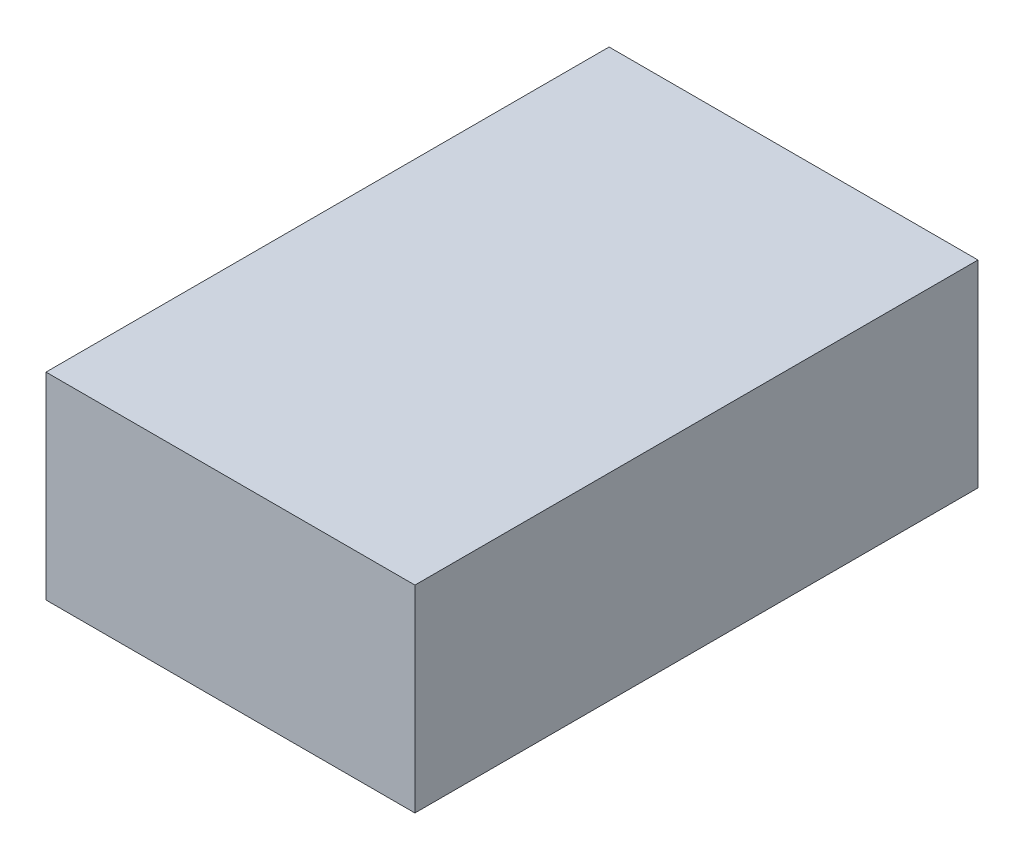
ISO-10303-21;
HEADER;
FILE_DESCRIPTION(('STEP AP214'),'2;1');
FILE_NAME('part.step','',(''),(''),'','','');
FILE_SCHEMA(('AUTOMOTIVE_DESIGN { 1 0 10303 214 1 1 1 1 }'));
ENDSEC;
DATA;
#1=APPLICATION_CONTEXT('core data for automotive mechanical design processes');
#2=APPLICATION_PROTOCOL_DEFINITION('international standard','automotive_design',2000,#1);
#3=PRODUCT_CONTEXT('',#1,'mechanical');
#4=PRODUCT('Part','Part','',(#3));
#5=PRODUCT_RELATED_PRODUCT_CATEGORY('part','',(#4));
#6=PRODUCT_DEFINITION_FORMATION('','',#4);
#7=PRODUCT_DEFINITION_CONTEXT('part definition',#1,'design');
#8=PRODUCT_DEFINITION('design','',#6,#7);
#9=PRODUCT_DEFINITION_SHAPE('','',#8);
#10=(LENGTH_UNIT() NAMED_UNIT(*) SI_UNIT(.MILLI.,.METRE.));
#11=(NAMED_UNIT(*) PLANE_ANGLE_UNIT() SI_UNIT($,.RADIAN.));
#12=(NAMED_UNIT(*) SI_UNIT($,.STERADIAN.) SOLID_ANGLE_UNIT());
#13=UNCERTAINTY_MEASURE_WITH_UNIT(LENGTH_MEASURE(1.E-05),#10,'distance_accuracy_value','');
#14=(GEOMETRIC_REPRESENTATION_CONTEXT(3) GLOBAL_UNCERTAINTY_ASSIGNED_CONTEXT((#13)) GLOBAL_UNIT_ASSIGNED_CONTEXT((#10,
#11,#12)) REPRESENTATION_CONTEXT('',''));
#15=CARTESIAN_POINT('',(0.,0.,0.));
#16=DIRECTION('',(0.,0.,1.));
#17=DIRECTION('',(1.,0.,0.));
#18=AXIS2_PLACEMENT_3D('',#15,#16,#17);
#19=CARTESIAN_POINT('',(0.,30.5,0.));
#20=DIRECTION('',(-1.,0.,0.));
#21=DIRECTION('',(0.,0.,1.));
#22=AXIS2_PLACEMENT_3D('',#19,#20,#21);
#23=PLANE('',#22);
#24=DIRECTION('',(0.,0.,-1.));
#25=VECTOR('',#24,1.);
#26=CARTESIAN_POINT('',(0.,0.,0.));
#27=LINE('',#26,#25);
#28=CARTESIAN_POINT('',(0.,0.,0.));
#29=VERTEX_POINT('',#28);
#30=CARTESIAN_POINT('',(0.,0.,-87.));
#31=VERTEX_POINT('',#30);
#32=EDGE_CURVE('E95',#29,#31,#27,.T.);
#33=ORIENTED_EDGE('',*,*,#32,.T.);
#34=DIRECTION('',(0.,-1.,0.));
#35=VECTOR('',#34,1.);
#36=CARTESIAN_POINT('',(0.,30.5,-87.));
#37=LINE('',#36,#35);
#38=CARTESIAN_POINT('',(0.,30.5,-87.));
#39=VERTEX_POINT('',#38);
#40=EDGE_CURVE('E11',#39,#31,#37,.T.);
#41=ORIENTED_EDGE('',*,*,#40,.F.);
#42=DIRECTION('',(0.,0.,-1.));
#43=VECTOR('',#42,1.);
#44=CARTESIAN_POINT('',(0.,30.5,0.));
#45=LINE('',#44,#43);
#46=CARTESIAN_POINT('',(0.,30.5,0.));
#47=VERTEX_POINT('',#46);
#48=EDGE_CURVE('E83',#47,#39,#45,.T.);
#49=ORIENTED_EDGE('',*,*,#48,.F.);
#50=DIRECTION('',(0.,-1.,0.));
#51=VECTOR('',#50,1.);
#52=CARTESIAN_POINT('',(0.,30.5,0.));
#53=LINE('',#52,#51);
#54=EDGE_CURVE('E91',#47,#29,#53,.T.);
#55=ORIENTED_EDGE('',*,*,#54,.T.);
#56=EDGE_LOOP('',(#33,#41,#49,#55));
#57=FACE_BOUND('',#56,.T.);
#58=ADVANCED_FACE('F32',(#57),#23,.F.);
#59=CARTESIAN_POINT('',(0.,30.5,-87.));
#60=DIRECTION('',(0.,0.,1.));
#61=DIRECTION('',(1.,0.,0.));
#62=AXIS2_PLACEMENT_3D('',#59,#60,#61);
#63=PLANE('',#62);
#64=DIRECTION('',(-1.,0.,0.));
#65=VECTOR('',#64,1.);
#66=CARTESIAN_POINT('',(0.,0.,-87.));
#67=LINE('',#66,#65);
#68=CARTESIAN_POINT('',(-57.,0.,-87.));
#69=VERTEX_POINT('',#68);
#70=EDGE_CURVE('E87',#31,#69,#67,.T.);
#71=ORIENTED_EDGE('',*,*,#70,.T.);
#72=DIRECTION('',(0.,-1.,0.));
#73=VECTOR('',#72,1.);
#74=CARTESIAN_POINT('',(-57.,30.5,-87.));
#75=LINE('',#74,#73);
#76=CARTESIAN_POINT('',(-57.,30.5,-87.));
#77=VERTEX_POINT('',#76);
#78=EDGE_CURVE('E40',#77,#69,#75,.T.);
#79=ORIENTED_EDGE('',*,*,#78,.F.);
#80=DIRECTION('',(-1.,0.,0.));
#81=VECTOR('',#80,1.);
#82=CARTESIAN_POINT('',(0.,30.5,-87.));
#83=LINE('',#82,#81);
#84=EDGE_CURVE('E78',#39,#77,#83,.T.);
#85=ORIENTED_EDGE('',*,*,#84,.F.);
#86=ORIENTED_EDGE('',*,*,#40,.T.);
#87=EDGE_LOOP('',(#71,#79,#85,#86));
#88=FACE_BOUND('',#87,.T.);
#89=ADVANCED_FACE('F86',(#88),#63,.F.);
#90=CARTESIAN_POINT('',(-57.,30.5,0.));
#91=DIRECTION('',(1.,0.,0.));
#92=DIRECTION('',(0.,0.,-1.));
#93=AXIS2_PLACEMENT_3D('',#90,#91,#92);
#94=PLANE('',#93);
#95=DIRECTION('',(0.,0.,1.));
#96=VECTOR('',#95,1.);
#97=CARTESIAN_POINT('',(-57.,0.,0.));
#98=LINE('',#97,#96);
#99=CARTESIAN_POINT('',(-57.,0.,0.));
#100=VERTEX_POINT('',#99);
#101=EDGE_CURVE('E65',#69,#100,#98,.T.);
#102=ORIENTED_EDGE('',*,*,#101,.T.);
#103=DIRECTION('',(0.,-1.,0.));
#104=VECTOR('',#103,1.);
#105=CARTESIAN_POINT('',(-57.,30.5,0.));
#106=LINE('',#105,#104);
#107=CARTESIAN_POINT('',(-57.,30.5,0.));
#108=VERTEX_POINT('',#107);
#109=EDGE_CURVE('E88',#108,#100,#106,.T.);
#110=ORIENTED_EDGE('',*,*,#109,.F.);
#111=DIRECTION('',(0.,0.,1.));
#112=VECTOR('',#111,1.);
#113=CARTESIAN_POINT('',(-57.,30.5,0.));
#114=LINE('',#113,#112);
#115=EDGE_CURVE('E81',#77,#108,#114,.T.);
#116=ORIENTED_EDGE('',*,*,#115,.F.);
#117=ORIENTED_EDGE('',*,*,#78,.T.);
#118=EDGE_LOOP('',(#102,#110,#116,#117));
#119=FACE_BOUND('',#118,.T.);
#120=ADVANCED_FACE('F89',(#119),#94,.F.);
#121=CARTESIAN_POINT('',(0.,30.5,0.));
#122=DIRECTION('',(0.,0.,-1.));
#123=DIRECTION('',(-1.,0.,0.));
#124=AXIS2_PLACEMENT_3D('',#121,#122,#123);
#125=PLANE('',#124);
#126=DIRECTION('',(1.,0.,0.));
#127=VECTOR('',#126,1.);
#128=CARTESIAN_POINT('',(0.,0.,0.));
#129=LINE('',#128,#127);
#130=EDGE_CURVE('E71',#100,#29,#129,.T.);
#131=ORIENTED_EDGE('',*,*,#130,.T.);
#132=ORIENTED_EDGE('',*,*,#54,.F.);
#133=DIRECTION('',(1.,0.,0.));
#134=VECTOR('',#133,1.);
#135=CARTESIAN_POINT('',(0.,30.5,0.));
#136=LINE('',#135,#134);
#137=EDGE_CURVE('E48',#108,#47,#136,.T.);
#138=ORIENTED_EDGE('',*,*,#137,.F.);
#139=ORIENTED_EDGE('',*,*,#109,.T.);
#140=EDGE_LOOP('',(#131,#132,#138,#139));
#141=FACE_BOUND('',#140,.T.);
#142=ADVANCED_FACE('F102',(#141),#125,.F.);
#143=CARTESIAN_POINT('',(0.,30.5,0.));
#144=DIRECTION('',(0.,1.,0.));
#145=DIRECTION('',(0.,0.,1.));
#146=AXIS2_PLACEMENT_3D('',#143,#144,#145);
#147=PLANE('',#146);
#148=ORIENTED_EDGE('',*,*,#48,.T.);
#149=ORIENTED_EDGE('',*,*,#84,.T.);
#150=ORIENTED_EDGE('',*,*,#115,.T.);
#151=ORIENTED_EDGE('',*,*,#137,.T.);
#152=EDGE_LOOP('',(#148,#149,#150,#151));
#153=FACE_BOUND('',#152,.T.);
#154=ADVANCED_FACE('F79',(#153),#147,.T.);
#155=CARTESIAN_POINT('',(0.,0.,0.));
#156=DIRECTION('',(0.,1.,0.));
#157=DIRECTION('',(0.,0.,1.));
#158=AXIS2_PLACEMENT_3D('',#155,#156,#157);
#159=PLANE('',#158);
#160=ORIENTED_EDGE('',*,*,#32,.F.);
#161=ORIENTED_EDGE('',*,*,#130,.F.);
#162=ORIENTED_EDGE('',*,*,#101,.F.);
#163=ORIENTED_EDGE('',*,*,#70,.F.);
#164=EDGE_LOOP('',(#160,#161,#162,#163));
#165=FACE_BOUND('',#164,.T.);
#166=ADVANCED_FACE('F105',(#165),#159,.F.);
#167=CLOSED_SHELL('',(#58,#89,#120,#142,#154,#166));
#168=MANIFOLD_SOLID_BREP('B2',#167);
#169=ADVANCED_BREP_SHAPE_REPRESENTATION('',(#18,#168),#14);
#170=SHAPE_DEFINITION_REPRESENTATION(#9,#169);
ENDSEC;
END-ISO-10303-21;
